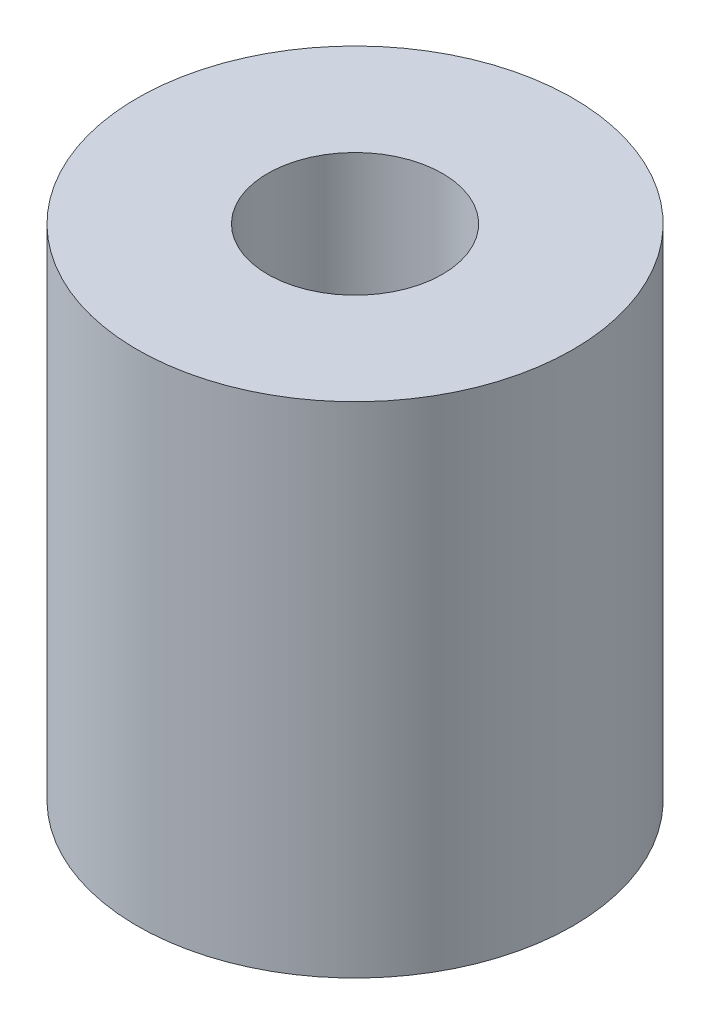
ISO-10303-21;
HEADER;
FILE_DESCRIPTION(('STEP AP214'),'2;1');
FILE_NAME('part.step','',(''),(''),'','','');
FILE_SCHEMA(('AUTOMOTIVE_DESIGN { 1 0 10303 214 1 1 1 1 }'));
ENDSEC;
DATA;
#1=APPLICATION_CONTEXT('core data for automotive mechanical design processes');
#2=APPLICATION_PROTOCOL_DEFINITION('international standard','automotive_design',2000,#1);
#3=PRODUCT_CONTEXT('',#1,'mechanical');
#4=PRODUCT('Part','Part','',(#3));
#5=PRODUCT_RELATED_PRODUCT_CATEGORY('part','',(#4));
#6=PRODUCT_DEFINITION_FORMATION('','',#4);
#7=PRODUCT_DEFINITION_CONTEXT('part definition',#1,'design');
#8=PRODUCT_DEFINITION('design','',#6,#7);
#9=PRODUCT_DEFINITION_SHAPE('','',#8);
#10=(LENGTH_UNIT() NAMED_UNIT(*) SI_UNIT(.MILLI.,.METRE.));
#11=(NAMED_UNIT(*) PLANE_ANGLE_UNIT() SI_UNIT($,.RADIAN.));
#12=(NAMED_UNIT(*) SI_UNIT($,.STERADIAN.) SOLID_ANGLE_UNIT());
#13=UNCERTAINTY_MEASURE_WITH_UNIT(LENGTH_MEASURE(1.E-05),#10,'distance_accuracy_value','');
#14=(GEOMETRIC_REPRESENTATION_CONTEXT(3) GLOBAL_UNCERTAINTY_ASSIGNED_CONTEXT((#13)) GLOBAL_UNIT_ASSIGNED_CONTEXT((#10,
#11,#12)) REPRESENTATION_CONTEXT('',''));
#15=CARTESIAN_POINT('',(0.,0.,0.));
#16=DIRECTION('',(0.,0.,1.));
#17=DIRECTION('',(1.,0.,0.));
#18=AXIS2_PLACEMENT_3D('',#15,#16,#17);
#19=CARTESIAN_POINT('',(0.,9.04999999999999,0.));
#20=DIRECTION('',(0.,-1.,0.));
#21=DIRECTION('',(1.,0.,0.));
#22=AXIS2_PLACEMENT_3D('',#19,#20,#21);
#23=CYLINDRICAL_SURFACE('',#22,7.9);
#24=CARTESIAN_POINT('',(0.,9.04999999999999,0.));
#25=DIRECTION('',(0.,-1.,0.));
#26=DIRECTION('',(1.,0.,0.));
#27=AXIS2_PLACEMENT_3D('',#24,#25,#26);
#28=CIRCLE('',#27,7.9);
#29=CARTESIAN_POINT('',(7.9,9.04999999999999,0.));
#30=VERTEX_POINT('',#29);
#31=EDGE_CURVE('E10',#30,#30,#28,.T.);
#32=ORIENTED_EDGE('',*,*,#31,.T.);
#33=EDGE_LOOP('',(#32));
#34=FACE_BOUND('',#33,.T.);
#35=CARTESIAN_POINT('',(0.,-9.05,0.));
#36=DIRECTION('',(0.,-1.,0.));
#37=DIRECTION('',(1.,0.,0.));
#38=AXIS2_PLACEMENT_3D('',#35,#36,#37);
#39=CIRCLE('',#38,7.9);
#40=CARTESIAN_POINT('',(7.9,-9.05,0.));
#41=VERTEX_POINT('',#40);
#42=EDGE_CURVE('E44',#41,#41,#39,.T.);
#43=ORIENTED_EDGE('',*,*,#42,.F.);
#44=EDGE_LOOP('',(#43));
#45=FACE_BOUND('',#44,.T.);
#46=ADVANCED_FACE('F30',(#34,#45),#23,.T.);
#47=CARTESIAN_POINT('',(7.9,9.04999999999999,0.));
#48=DIRECTION('',(0.,1.,0.));
#49=DIRECTION('',(-1.,0.,0.));
#50=AXIS2_PLACEMENT_3D('',#47,#48,#49);
#51=PLANE('',#50);
#52=CARTESIAN_POINT('',(0.,9.04999999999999,0.));
#53=DIRECTION('',(0.,-1.,0.));
#54=DIRECTION('',(1.,0.,0.));
#55=AXIS2_PLACEMENT_3D('',#52,#53,#54);
#56=CIRCLE('',#55,3.17);
#57=CARTESIAN_POINT('',(3.17,9.04999999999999,0.));
#58=VERTEX_POINT('',#57);
#59=EDGE_CURVE('E36',#58,#58,#56,.T.);
#60=ORIENTED_EDGE('',*,*,#59,.T.);
#61=EDGE_LOOP('',(#60));
#62=FACE_BOUND('',#61,.T.);
#63=ORIENTED_EDGE('',*,*,#31,.F.);
#64=EDGE_LOOP('',(#63));
#65=FACE_BOUND('',#64,.T.);
#66=ADVANCED_FACE('F54',(#62,#65),#51,.T.);
#67=CARTESIAN_POINT('',(0.,9.04999999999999,0.));
#68=DIRECTION('',(0.,-1.,0.));
#69=DIRECTION('',(1.,0.,0.));
#70=AXIS2_PLACEMENT_3D('',#67,#68,#69);
#71=CYLINDRICAL_SURFACE('',#70,3.17);
#72=CARTESIAN_POINT('',(0.,-9.05,0.));
#73=DIRECTION('',(0.,-1.,0.));
#74=DIRECTION('',(1.,0.,0.));
#75=AXIS2_PLACEMENT_3D('',#72,#73,#74);
#76=CIRCLE('',#75,3.17);
#77=CARTESIAN_POINT('',(3.17,-9.05,0.));
#78=VERTEX_POINT('',#77);
#79=EDGE_CURVE('E40',#78,#78,#76,.T.);
#80=ORIENTED_EDGE('',*,*,#79,.T.);
#81=EDGE_LOOP('',(#80));
#82=FACE_BOUND('',#81,.T.);
#83=ORIENTED_EDGE('',*,*,#59,.F.);
#84=EDGE_LOOP('',(#83));
#85=FACE_BOUND('',#84,.T.);
#86=ADVANCED_FACE('F58',(#82,#85),#71,.F.);
#87=CARTESIAN_POINT('',(3.17,-9.05,0.));
#88=DIRECTION('',(0.,-1.,0.));
#89=DIRECTION('',(1.,0.,0.));
#90=AXIS2_PLACEMENT_3D('',#87,#88,#89);
#91=PLANE('',#90);
#92=ORIENTED_EDGE('',*,*,#42,.T.);
#93=EDGE_LOOP('',(#92));
#94=FACE_BOUND('',#93,.T.);
#95=ORIENTED_EDGE('',*,*,#79,.F.);
#96=EDGE_LOOP('',(#95));
#97=FACE_BOUND('',#96,.T.);
#98=ADVANCED_FACE('F50',(#94,#97),#91,.T.);
#99=CLOSED_SHELL('',(#46,#66,#86,#98));
#100=MANIFOLD_SOLID_BREP('B2',#99);
#101=ADVANCED_BREP_SHAPE_REPRESENTATION('',(#18,#100),#14);
#102=SHAPE_DEFINITION_REPRESENTATION(#9,#101);
ENDSEC;
END-ISO-10303-21;
